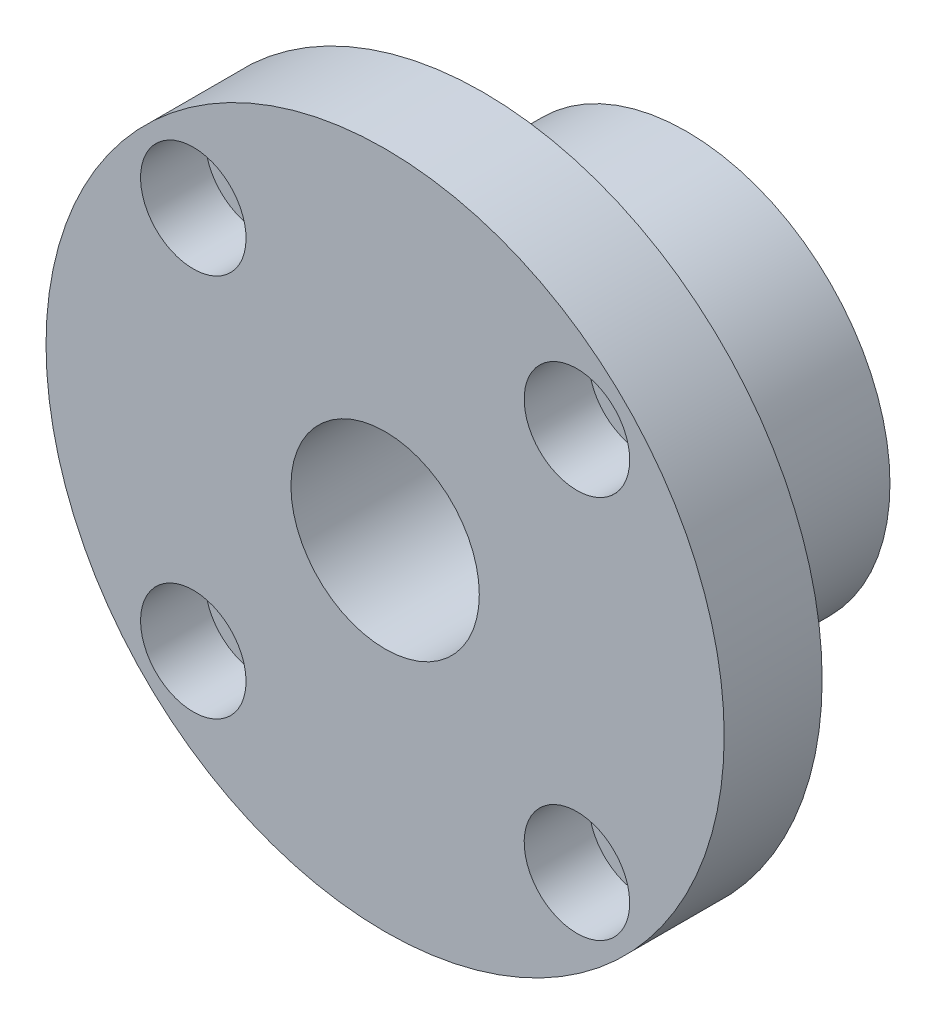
ISO-10303-21;
HEADER;
FILE_DESCRIPTION(('STEP AP214'),'2;1');
FILE_NAME('part.step','',(''),(''),'','','');
FILE_SCHEMA(('AUTOMOTIVE_DESIGN { 1 0 10303 214 1 1 1 1 }'));
ENDSEC;
DATA;
#1=APPLICATION_CONTEXT('core data for automotive mechanical design processes');
#2=APPLICATION_PROTOCOL_DEFINITION('international standard','automotive_design',2000,#1);
#3=PRODUCT_CONTEXT('',#1,'mechanical');
#4=PRODUCT('Part','Part','',(#3));
#5=PRODUCT_RELATED_PRODUCT_CATEGORY('part','',(#4));
#6=PRODUCT_DEFINITION_FORMATION('','',#4);
#7=PRODUCT_DEFINITION_CONTEXT('part definition',#1,'design');
#8=PRODUCT_DEFINITION('design','',#6,#7);
#9=PRODUCT_DEFINITION_SHAPE('','',#8);
#10=(LENGTH_UNIT() NAMED_UNIT(*) SI_UNIT(.MILLI.,.METRE.));
#11=(NAMED_UNIT(*) PLANE_ANGLE_UNIT() SI_UNIT($,.RADIAN.));
#12=(NAMED_UNIT(*) SI_UNIT($,.STERADIAN.) SOLID_ANGLE_UNIT());
#13=UNCERTAINTY_MEASURE_WITH_UNIT(LENGTH_MEASURE(1.E-05),#10,'distance_accuracy_value','');
#14=(GEOMETRIC_REPRESENTATION_CONTEXT(3) GLOBAL_UNCERTAINTY_ASSIGNED_CONTEXT((#13)) GLOBAL_UNIT_ASSIGNED_CONTEXT((#10,
#11,#12)) REPRESENTATION_CONTEXT('',''));
#15=CARTESIAN_POINT('',(0.,0.,0.));
#16=DIRECTION('',(0.,0.,1.));
#17=DIRECTION('',(1.,0.,0.));
#18=AXIS2_PLACEMENT_3D('',#15,#16,#17);
#19=CARTESIAN_POINT('',(0.,0.,0.));
#20=DIRECTION('',(0.,0.,1.));
#21=DIRECTION('',(1.,0.,0.));
#22=AXIS2_PLACEMENT_3D('',#19,#20,#21);
#23=PLANE('',#22);
#24=CARTESIAN_POINT('',(0.,0.,0.));
#25=DIRECTION('',(0.,0.,1.));
#26=DIRECTION('',(1.,0.,0.));
#27=AXIS2_PLACEMENT_3D('',#24,#25,#26);
#28=CIRCLE('',#27,45.);
#29=CARTESIAN_POINT('',(45.,0.,0.));
#30=VERTEX_POINT('',#29);
#31=EDGE_CURVE('E23',#30,#30,#28,.T.);
#32=ORIENTED_EDGE('',*,*,#31,.F.);
#33=EDGE_LOOP('',(#32));
#34=FACE_BOUND('',#33,.T.);
#35=CARTESIAN_POINT('',(25.4558441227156,25.4558441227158,0.));
#36=DIRECTION('',(0.,0.,1.));
#37=DIRECTION('',(1.,0.,0.));
#38=AXIS2_PLACEMENT_3D('',#35,#36,#37);
#39=CIRCLE('',#38,5.);
#40=CARTESIAN_POINT('',(30.4558441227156,25.4558441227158,0.));
#41=VERTEX_POINT('',#40);
#42=EDGE_CURVE('E35',#41,#41,#39,.T.);
#43=ORIENTED_EDGE('',*,*,#42,.T.);
#44=EDGE_LOOP('',(#43));
#45=FACE_BOUND('',#44,.T.);
#46=CARTESIAN_POINT('',(25.4558441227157,-25.4558441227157,0.));
#47=DIRECTION('',(0.,0.,1.));
#48=DIRECTION('',(0.,-1.,0.));
#49=AXIS2_PLACEMENT_3D('',#46,#47,#48);
#50=CIRCLE('',#49,5.);
#51=CARTESIAN_POINT('',(25.4558441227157,-30.4558441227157,0.));
#52=VERTEX_POINT('',#51);
#53=EDGE_CURVE('E75',#52,#52,#50,.T.);
#54=ORIENTED_EDGE('',*,*,#53,.T.);
#55=EDGE_LOOP('',(#54));
#56=FACE_BOUND('',#55,.T.);
#57=CARTESIAN_POINT('',(-25.4558441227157,-25.4558441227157,0.));
#58=DIRECTION('',(0.,0.,1.));
#59=DIRECTION('',(-1.,0.,0.));
#60=AXIS2_PLACEMENT_3D('',#57,#58,#59);
#61=CIRCLE('',#60,5.);
#62=CARTESIAN_POINT('',(-30.4558441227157,-25.4558441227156,0.));
#63=VERTEX_POINT('',#62);
#64=EDGE_CURVE('E72',#63,#63,#61,.T.);
#65=ORIENTED_EDGE('',*,*,#64,.T.);
#66=EDGE_LOOP('',(#65));
#67=FACE_BOUND('',#66,.T.);
#68=CARTESIAN_POINT('',(-25.4558441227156,25.4558441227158,0.));
#69=DIRECTION('',(0.,0.,1.));
#70=DIRECTION('',(0.,1.,0.));
#71=AXIS2_PLACEMENT_3D('',#68,#69,#70);
#72=CIRCLE('',#71,5.);
#73=CARTESIAN_POINT('',(-25.4558441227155,30.4558441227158,0.));
#74=VERTEX_POINT('',#73);
#75=EDGE_CURVE('E40',#74,#74,#72,.T.);
#76=ORIENTED_EDGE('',*,*,#75,.T.);
#77=EDGE_LOOP('',(#76));
#78=FACE_BOUND('',#77,.T.);
#79=CARTESIAN_POINT('',(0.,0.,0.));
#80=DIRECTION('',(0.,0.,1.));
#81=DIRECTION('',(1.,0.,0.));
#82=AXIS2_PLACEMENT_3D('',#79,#80,#81);
#83=CIRCLE('',#82,27.);
#84=CARTESIAN_POINT('',(27.,0.,0.));
#85=VERTEX_POINT('',#84);
#86=EDGE_CURVE('E8',#85,#85,#83,.F.);
#87=ORIENTED_EDGE('',*,*,#86,.F.);
#88=EDGE_LOOP('',(#87));
#89=FACE_BOUND('',#88,.T.);
#90=ADVANCED_FACE('F12',(#34,#45,#56,#67,#78,#89),#23,.F.);
#91=CARTESIAN_POINT('',(-25.4558441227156,25.4558441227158,0.));
#92=DIRECTION('',(0.,0.,1.));
#93=DIRECTION('',(1.,0.,0.));
#94=AXIS2_PLACEMENT_3D('',#91,#92,#93);
#95=CYLINDRICAL_SURFACE('',#94,5.);
#96=ORIENTED_EDGE('',*,*,#75,.F.);
#97=EDGE_LOOP('',(#96));
#98=FACE_BOUND('',#97,.T.);
#99=CARTESIAN_POINT('',(-25.4558441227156,25.4558441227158,4.4));
#100=DIRECTION('',(0.,0.,1.));
#101=DIRECTION('',(1.,0.,0.));
#102=AXIS2_PLACEMENT_3D('',#99,#100,#101);
#103=CIRCLE('',#102,5.);
#104=CARTESIAN_POINT('',(-20.4558441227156,25.4558441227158,4.4));
#105=VERTEX_POINT('',#104);
#106=EDGE_CURVE('E46',#105,#105,#103,.F.);
#107=ORIENTED_EDGE('',*,*,#106,.F.);
#108=EDGE_LOOP('',(#107));
#109=FACE_BOUND('',#108,.T.);
#110=ADVANCED_FACE('F120',(#98,#109),#95,.F.);
#111=CARTESIAN_POINT('',(-25.4558441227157,-25.4558441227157,0.));
#112=DIRECTION('',(0.,0.,1.));
#113=DIRECTION('',(1.,0.,0.));
#114=AXIS2_PLACEMENT_3D('',#111,#112,#113);
#115=CYLINDRICAL_SURFACE('',#114,5.);
#116=ORIENTED_EDGE('',*,*,#64,.F.);
#117=EDGE_LOOP('',(#116));
#118=FACE_BOUND('',#117,.T.);
#119=CARTESIAN_POINT('',(-25.4558441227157,-25.4558441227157,4.4));
#120=DIRECTION('',(0.,0.,1.));
#121=DIRECTION('',(1.,0.,0.));
#122=AXIS2_PLACEMENT_3D('',#119,#120,#121);
#123=CIRCLE('',#122,5.);
#124=CARTESIAN_POINT('',(-20.4558441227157,-25.4558441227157,4.4));
#125=VERTEX_POINT('',#124);
#126=EDGE_CURVE('E42',#125,#125,#123,.F.);
#127=ORIENTED_EDGE('',*,*,#126,.F.);
#128=EDGE_LOOP('',(#127));
#129=FACE_BOUND('',#128,.T.);
#130=ADVANCED_FACE('F126',(#118,#129),#115,.F.);
#131=CARTESIAN_POINT('',(25.4558441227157,-25.4558441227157,0.));
#132=DIRECTION('',(0.,0.,1.));
#133=DIRECTION('',(1.,0.,0.));
#134=AXIS2_PLACEMENT_3D('',#131,#132,#133);
#135=CYLINDRICAL_SURFACE('',#134,5.);
#136=ORIENTED_EDGE('',*,*,#53,.F.);
#137=EDGE_LOOP('',(#136));
#138=FACE_BOUND('',#137,.T.);
#139=CARTESIAN_POINT('',(25.4558441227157,-25.4558441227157,4.4));
#140=DIRECTION('',(0.,0.,1.));
#141=DIRECTION('',(1.,0.,0.));
#142=AXIS2_PLACEMENT_3D('',#139,#140,#141);
#143=CIRCLE('',#142,5.);
#144=CARTESIAN_POINT('',(30.4558441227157,-25.4558441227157,4.4));
#145=VERTEX_POINT('',#144);
#146=EDGE_CURVE('E37',#145,#145,#143,.F.);
#147=ORIENTED_EDGE('',*,*,#146,.F.);
#148=EDGE_LOOP('',(#147));
#149=FACE_BOUND('',#148,.T.);
#150=ADVANCED_FACE('F137',(#138,#149),#135,.F.);
#151=CARTESIAN_POINT('',(25.4558441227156,25.4558441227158,0.));
#152=DIRECTION('',(0.,0.,1.));
#153=DIRECTION('',(1.,0.,0.));
#154=AXIS2_PLACEMENT_3D('',#151,#152,#153);
#155=CYLINDRICAL_SURFACE('',#154,5.);
#156=ORIENTED_EDGE('',*,*,#42,.F.);
#157=EDGE_LOOP('',(#156));
#158=FACE_BOUND('',#157,.T.);
#159=CARTESIAN_POINT('',(25.4558441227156,25.4558441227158,4.4));
#160=DIRECTION('',(0.,0.,1.));
#161=DIRECTION('',(1.,0.,0.));
#162=AXIS2_PLACEMENT_3D('',#159,#160,#161);
#163=CIRCLE('',#162,5.);
#164=CARTESIAN_POINT('',(30.4558441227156,25.4558441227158,4.4));
#165=VERTEX_POINT('',#164);
#166=EDGE_CURVE('E32',#165,#165,#163,.F.);
#167=ORIENTED_EDGE('',*,*,#166,.F.);
#168=EDGE_LOOP('',(#167));
#169=FACE_BOUND('',#168,.T.);
#170=ADVANCED_FACE('F92',(#158,#169),#155,.F.);
#171=CARTESIAN_POINT('',(0.,0.,13.));
#172=DIRECTION('',(0.,0.,1.));
#173=DIRECTION('',(1.,0.,0.));
#174=AXIS2_PLACEMENT_3D('',#171,#172,#173);
#175=PLANE('',#174);
#176=CARTESIAN_POINT('',(0.,0.,13.));
#177=DIRECTION('',(0.,0.,1.));
#178=DIRECTION('',(1.,0.,0.));
#179=AXIS2_PLACEMENT_3D('',#176,#177,#178);
#180=CIRCLE('',#179,12.5);
#181=CARTESIAN_POINT('',(12.5,0.,13.));
#182=VERTEX_POINT('',#181);
#183=EDGE_CURVE('E28',#182,#182,#180,.T.);
#184=ORIENTED_EDGE('',*,*,#183,.F.);
#185=EDGE_LOOP('',(#184));
#186=FACE_BOUND('',#185,.T.);
#187=CARTESIAN_POINT('',(0.,0.,13.));
#188=DIRECTION('',(0.,0.,1.));
#189=DIRECTION('',(1.,0.,0.));
#190=AXIS2_PLACEMENT_3D('',#187,#188,#189);
#191=CIRCLE('',#190,45.);
#192=CARTESIAN_POINT('',(45.,0.,13.));
#193=VERTEX_POINT('',#192);
#194=EDGE_CURVE('E19',#193,#193,#191,.T.);
#195=ORIENTED_EDGE('',*,*,#194,.T.);
#196=EDGE_LOOP('',(#195));
#197=FACE_BOUND('',#196,.T.);
#198=CARTESIAN_POINT('',(25.4558441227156,25.4558441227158,13.));
#199=DIRECTION('',(0.,0.,1.));
#200=DIRECTION('',(1.,0.,0.));
#201=AXIS2_PLACEMENT_3D('',#198,#199,#200);
#202=CIRCLE('',#201,7.);
#203=CARTESIAN_POINT('',(32.4558441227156,25.4558441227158,13.));
#204=VERTEX_POINT('',#203);
#205=EDGE_CURVE('E78',#204,#204,#202,.T.);
#206=ORIENTED_EDGE('',*,*,#205,.F.);
#207=EDGE_LOOP('',(#206));
#208=FACE_BOUND('',#207,.T.);
#209=CARTESIAN_POINT('',(25.4558441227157,-25.4558441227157,13.));
#210=DIRECTION('',(0.,0.,1.));
#211=DIRECTION('',(0.,-1.,0.));
#212=AXIS2_PLACEMENT_3D('',#209,#210,#211);
#213=CIRCLE('',#212,7.);
#214=CARTESIAN_POINT('',(25.4558441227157,-32.4558441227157,13.));
#215=VERTEX_POINT('',#214);
#216=EDGE_CURVE('E44',#215,#215,#213,.T.);
#217=ORIENTED_EDGE('',*,*,#216,.F.);
#218=EDGE_LOOP('',(#217));
#219=FACE_BOUND('',#218,.T.);
#220=CARTESIAN_POINT('',(-25.4558441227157,-25.4558441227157,13.));
#221=DIRECTION('',(0.,0.,1.));
#222=DIRECTION('',(-1.,0.,0.));
#223=AXIS2_PLACEMENT_3D('',#220,#221,#222);
#224=CIRCLE('',#223,7.);
#225=CARTESIAN_POINT('',(-32.4558441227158,-25.4558441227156,13.));
#226=VERTEX_POINT('',#225);
#227=EDGE_CURVE('E48',#226,#226,#224,.T.);
#228=ORIENTED_EDGE('',*,*,#227,.F.);
#229=EDGE_LOOP('',(#228));
#230=FACE_BOUND('',#229,.T.);
#231=CARTESIAN_POINT('',(-25.4558441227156,25.4558441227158,13.));
#232=DIRECTION('',(0.,0.,1.));
#233=DIRECTION('',(0.,1.,0.));
#234=AXIS2_PLACEMENT_3D('',#231,#232,#233);
#235=CIRCLE('',#234,7.);
#236=CARTESIAN_POINT('',(-25.4558441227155,32.4558441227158,13.));
#237=VERTEX_POINT('',#236);
#238=EDGE_CURVE('E55',#237,#237,#235,.T.);
#239=ORIENTED_EDGE('',*,*,#238,.F.);
#240=EDGE_LOOP('',(#239));
#241=FACE_BOUND('',#240,.T.);
#242=ADVANCED_FACE('F90',(#186,#197,#208,#219,#230,#241),#175,.T.);
#243=CARTESIAN_POINT('',(0.,0.,13.));
#244=DIRECTION('',(0.,0.,-1.));
#245=DIRECTION('',(-1.,0.,0.));
#246=AXIS2_PLACEMENT_3D('',#243,#244,#245);
#247=CYLINDRICAL_SURFACE('',#246,45.);
#248=ORIENTED_EDGE('',*,*,#194,.F.);
#249=EDGE_LOOP('',(#248));
#250=FACE_BOUND('',#249,.T.);
#251=ORIENTED_EDGE('',*,*,#31,.T.);
#252=EDGE_LOOP('',(#251));
#253=FACE_BOUND('',#252,.T.);
#254=ADVANCED_FACE('F14',(#250,#253),#247,.T.);
#255=CARTESIAN_POINT('',(0.,0.,13.));
#256=DIRECTION('',(0.,0.,-1.));
#257=DIRECTION('',(-1.,0.,0.));
#258=AXIS2_PLACEMENT_3D('',#255,#256,#257);
#259=CYLINDRICAL_SURFACE('',#258,12.5);
#260=ORIENTED_EDGE('',*,*,#183,.T.);
#261=EDGE_LOOP('',(#260));
#262=FACE_BOUND('',#261,.T.);
#263=CARTESIAN_POINT('',(0.,0.,-27.));
#264=DIRECTION('',(0.,0.,-1.));
#265=DIRECTION('',(-1.,0.,0.));
#266=AXIS2_PLACEMENT_3D('',#263,#264,#265);
#267=CIRCLE('',#266,12.5);
#268=CARTESIAN_POINT('',(-12.5,0.,-27.));
#269=VERTEX_POINT('',#268);
#270=EDGE_CURVE('E292',#269,#269,#267,.T.);
#271=ORIENTED_EDGE('',*,*,#270,.T.);
#272=EDGE_LOOP('',(#271));
#273=FACE_BOUND('',#272,.T.);
#274=ADVANCED_FACE('F87',(#262,#273),#259,.F.);
#275=CARTESIAN_POINT('',(25.4558441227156,25.4558441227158,4.4));
#276=DIRECTION('',(0.,0.,1.));
#277=DIRECTION('',(1.,0.,0.));
#278=AXIS2_PLACEMENT_3D('',#275,#276,#277);
#279=PLANE('',#278);
#280=CARTESIAN_POINT('',(25.4558441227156,25.4558441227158,4.4));
#281=DIRECTION('',(0.,0.,1.));
#282=DIRECTION('',(1.,0.,0.));
#283=AXIS2_PLACEMENT_3D('',#280,#281,#282);
#284=CIRCLE('',#283,7.);
#285=CARTESIAN_POINT('',(32.4558441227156,25.4558441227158,4.4));
#286=VERTEX_POINT('',#285);
#287=EDGE_CURVE('E36',#286,#286,#284,.T.);
#288=ORIENTED_EDGE('',*,*,#287,.T.);
#289=EDGE_LOOP('',(#288));
#290=FACE_BOUND('',#289,.T.);
#291=ORIENTED_EDGE('',*,*,#166,.T.);
#292=EDGE_LOOP('',(#291));
#293=FACE_BOUND('',#292,.T.);
#294=ADVANCED_FACE('F134',(#290,#293),#279,.T.);
#295=CARTESIAN_POINT('',(25.4558441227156,25.4558441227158,4.4));
#296=DIRECTION('',(0.,0.,1.));
#297=DIRECTION('',(1.,0.,0.));
#298=AXIS2_PLACEMENT_3D('',#295,#296,#297);
#299=CYLINDRICAL_SURFACE('',#298,7.);
#300=ORIENTED_EDGE('',*,*,#287,.F.);
#301=EDGE_LOOP('',(#300));
#302=FACE_BOUND('',#301,.T.);
#303=ORIENTED_EDGE('',*,*,#205,.T.);
#304=EDGE_LOOP('',(#303));
#305=FACE_BOUND('',#304,.T.);
#306=ADVANCED_FACE('F139',(#302,#305),#299,.F.);
#307=CARTESIAN_POINT('',(25.4558441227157,-25.4558441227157,4.4));
#308=DIRECTION('',(0.,0.,1.));
#309=DIRECTION('',(0.,-1.,0.));
#310=AXIS2_PLACEMENT_3D('',#307,#308,#309);
#311=PLANE('',#310);
#312=CARTESIAN_POINT('',(25.4558441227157,-25.4558441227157,4.4));
#313=DIRECTION('',(0.,0.,1.));
#314=DIRECTION('',(0.,-1.,0.));
#315=AXIS2_PLACEMENT_3D('',#312,#313,#314);
#316=CIRCLE('',#315,7.);
#317=CARTESIAN_POINT('',(25.4558441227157,-32.4558441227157,4.4));
#318=VERTEX_POINT('',#317);
#319=EDGE_CURVE('E41',#318,#318,#316,.T.);
#320=ORIENTED_EDGE('',*,*,#319,.T.);
#321=EDGE_LOOP('',(#320));
#322=FACE_BOUND('',#321,.T.);
#323=ORIENTED_EDGE('',*,*,#146,.T.);
#324=EDGE_LOOP('',(#323));
#325=FACE_BOUND('',#324,.T.);
#326=ADVANCED_FACE('F142',(#322,#325),#311,.T.);
#327=CARTESIAN_POINT('',(25.4558441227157,-25.4558441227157,4.4));
#328=DIRECTION('',(0.,0.,1.));
#329=DIRECTION('',(1.,0.,0.));
#330=AXIS2_PLACEMENT_3D('',#327,#328,#329);
#331=CYLINDRICAL_SURFACE('',#330,7.);
#332=ORIENTED_EDGE('',*,*,#319,.F.);
#333=EDGE_LOOP('',(#332));
#334=FACE_BOUND('',#333,.T.);
#335=ORIENTED_EDGE('',*,*,#216,.T.);
#336=EDGE_LOOP('',(#335));
#337=FACE_BOUND('',#336,.T.);
#338=ADVANCED_FACE('F153',(#334,#337),#331,.F.);
#339=CARTESIAN_POINT('',(-25.4558441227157,-25.4558441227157,4.4));
#340=DIRECTION('',(0.,0.,1.));
#341=DIRECTION('',(-1.,0.,0.));
#342=AXIS2_PLACEMENT_3D('',#339,#340,#341);
#343=PLANE('',#342);
#344=CARTESIAN_POINT('',(-25.4558441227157,-25.4558441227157,4.4));
#345=DIRECTION('',(0.,0.,1.));
#346=DIRECTION('',(-1.,0.,0.));
#347=AXIS2_PLACEMENT_3D('',#344,#345,#346);
#348=CIRCLE('',#347,7.);
#349=CARTESIAN_POINT('',(-32.4558441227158,-25.4558441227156,4.4));
#350=VERTEX_POINT('',#349);
#351=EDGE_CURVE('E45',#350,#350,#348,.T.);
#352=ORIENTED_EDGE('',*,*,#351,.T.);
#353=EDGE_LOOP('',(#352));
#354=FACE_BOUND('',#353,.T.);
#355=ORIENTED_EDGE('',*,*,#126,.T.);
#356=EDGE_LOOP('',(#355));
#357=FACE_BOUND('',#356,.T.);
#358=ADVANCED_FACE('F156',(#354,#357),#343,.T.);
#359=CARTESIAN_POINT('',(-25.4558441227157,-25.4558441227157,4.4));
#360=DIRECTION('',(0.,0.,1.));
#361=DIRECTION('',(1.,0.,0.));
#362=AXIS2_PLACEMENT_3D('',#359,#360,#361);
#363=CYLINDRICAL_SURFACE('',#362,7.);
#364=ORIENTED_EDGE('',*,*,#351,.F.);
#365=EDGE_LOOP('',(#364));
#366=FACE_BOUND('',#365,.T.);
#367=ORIENTED_EDGE('',*,*,#227,.T.);
#368=EDGE_LOOP('',(#367));
#369=FACE_BOUND('',#368,.T.);
#370=ADVANCED_FACE('F116',(#366,#369),#363,.F.);
#371=CARTESIAN_POINT('',(-25.4558441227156,25.4558441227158,4.4));
#372=DIRECTION('',(0.,0.,1.));
#373=DIRECTION('',(0.,1.,0.));
#374=AXIS2_PLACEMENT_3D('',#371,#372,#373);
#375=PLANE('',#374);
#376=CARTESIAN_POINT('',(-25.4558441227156,25.4558441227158,4.4));
#377=DIRECTION('',(0.,0.,1.));
#378=DIRECTION('',(0.,1.,0.));
#379=AXIS2_PLACEMENT_3D('',#376,#377,#378);
#380=CIRCLE('',#379,7.);
#381=CARTESIAN_POINT('',(-25.4558441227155,32.4558441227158,4.4));
#382=VERTEX_POINT('',#381);
#383=EDGE_CURVE('E49',#382,#382,#380,.T.);
#384=ORIENTED_EDGE('',*,*,#383,.T.);
#385=EDGE_LOOP('',(#384));
#386=FACE_BOUND('',#385,.T.);
#387=ORIENTED_EDGE('',*,*,#106,.T.);
#388=EDGE_LOOP('',(#387));
#389=FACE_BOUND('',#388,.T.);
#390=ADVANCED_FACE('F105',(#386,#389),#375,.T.);
#391=CARTESIAN_POINT('',(-25.4558441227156,25.4558441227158,4.4));
#392=DIRECTION('',(0.,0.,1.));
#393=DIRECTION('',(1.,0.,0.));
#394=AXIS2_PLACEMENT_3D('',#391,#392,#393);
#395=CYLINDRICAL_SURFACE('',#394,7.);
#396=ORIENTED_EDGE('',*,*,#383,.F.);
#397=EDGE_LOOP('',(#396));
#398=FACE_BOUND('',#397,.T.);
#399=ORIENTED_EDGE('',*,*,#238,.T.);
#400=EDGE_LOOP('',(#399));
#401=FACE_BOUND('',#400,.T.);
#402=ADVANCED_FACE('F102',(#398,#401),#395,.F.);
#403=CARTESIAN_POINT('',(0.,0.,-27.));
#404=DIRECTION('',(0.,0.,1.));
#405=DIRECTION('',(1.,0.,0.));
#406=AXIS2_PLACEMENT_3D('',#403,#404,#405);
#407=CYLINDRICAL_SURFACE('',#406,27.);
#408=CARTESIAN_POINT('',(0.,0.,-27.));
#409=DIRECTION('',(0.,0.,-1.));
#410=DIRECTION('',(-1.,0.,0.));
#411=AXIS2_PLACEMENT_3D('',#408,#409,#410);
#412=CIRCLE('',#411,27.);
#413=CARTESIAN_POINT('',(-27.,0.,-27.));
#414=VERTEX_POINT('',#413);
#415=EDGE_CURVE('E60',#414,#414,#412,.T.);
#416=ORIENTED_EDGE('',*,*,#415,.F.);
#417=EDGE_LOOP('',(#416));
#418=FACE_BOUND('',#417,.T.);
#419=ORIENTED_EDGE('',*,*,#86,.T.);
#420=EDGE_LOOP('',(#419));
#421=FACE_BOUND('',#420,.T.);
#422=ADVANCED_FACE('F104',(#418,#421),#407,.T.);
#423=CARTESIAN_POINT('',(0.,0.,-27.));
#424=DIRECTION('',(0.,0.,-1.));
#425=DIRECTION('',(-1.,0.,0.));
#426=AXIS2_PLACEMENT_3D('',#423,#424,#425);
#427=PLANE('',#426);
#428=ORIENTED_EDGE('',*,*,#415,.T.);
#429=EDGE_LOOP('',(#428));
#430=FACE_BOUND('',#429,.T.);
#431=ORIENTED_EDGE('',*,*,#270,.F.);
#432=EDGE_LOOP('',(#431));
#433=FACE_BOUND('',#432,.T.);
#434=ADVANCED_FACE('F113',(#430,#433),#427,.T.);
#435=CLOSED_SHELL('',(#90,#110,#130,#150,#170,#242,#254,#274,#294,#306,#326,#338,#358,#370,#390,
#402,#422,#434));
#436=MANIFOLD_SOLID_BREP('B1',#435);
#437=ADVANCED_BREP_SHAPE_REPRESENTATION('',(#18,#436),#14);
#438=SHAPE_DEFINITION_REPRESENTATION(#9,#437);
ENDSEC;
END-ISO-10303-21;
